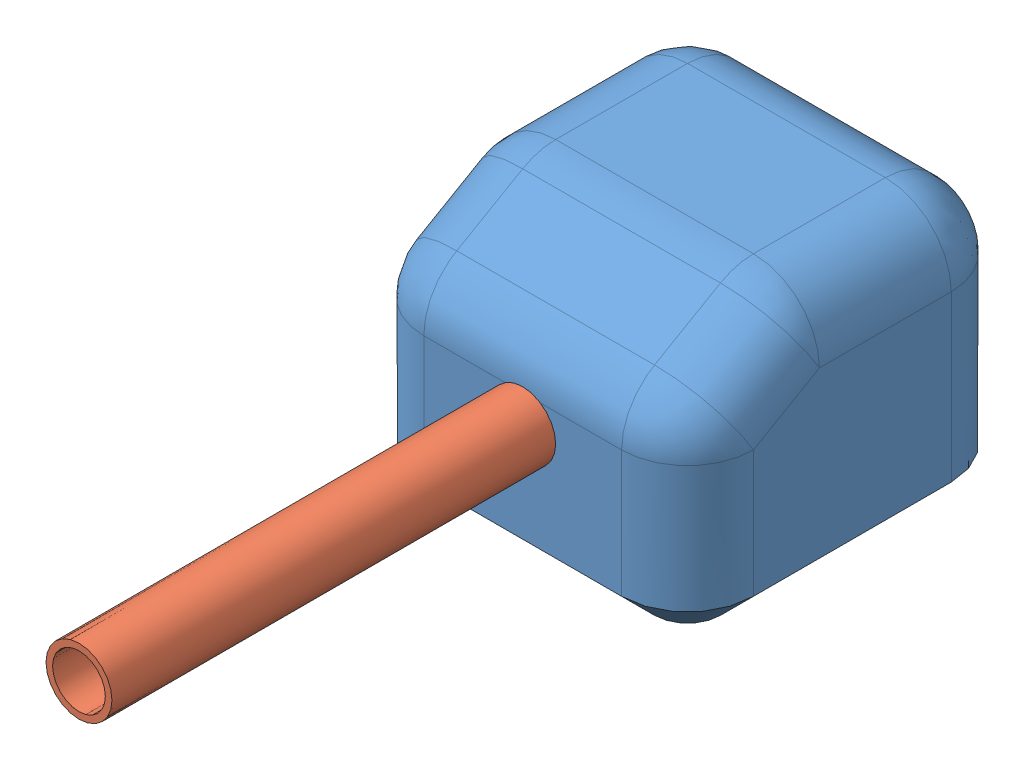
SolidWorks assembly Сборка1.sldasm, configuration Default (file format 3400). Lengths in mm.
Overall size (50 40 117.29).
2 component instances, 2 part files, 1 mates.
Components (placement in the parent):
- 003.02-1: 003.02.sldprt [Default] at (1.0373 -14.5904 1.5922) size (50 40 50)
- 003.01-1: 003.01.sldprt [Default] at (15.0238 -0.1554 -14.8815) size (10 10 100)
Mates (geometry in assembly coordinates):
- Концентрический1: concentric anti-aligned: cylinder of ?; cylinder of ?
